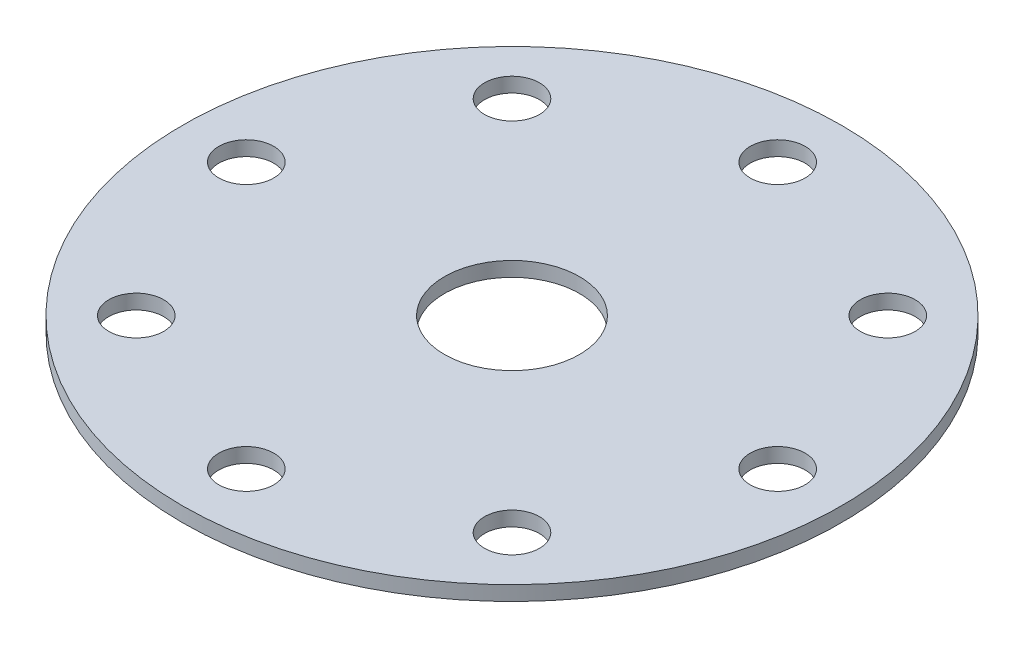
from build123d import *

# Parameters (mm, degrees)
SKETCH1_R                    = 57.15
BOSS_EXTRUDE1_DEPTH          = 2.54
F_1_12_TAPPED_HOLE1_D        = 23.41626
F_3_8_0_375_DIAMETER_HOLE1_D = 9.525


with BuildPart() as part:
    # Sketch1 → Boss-Extrude1 (new body)
    with BuildSketch(Plane(origin=(0, 0, 0), x_dir=(1, 0, 0), z_dir=(0, 1, 0))):
        with Locations(Location((0, 0, 0), (0, 0, 270))):
            Circle(SKETCH1_R)
    extrude(amount=BOSS_EXTRUDE1_DEPTH)

    # 1-12 Tapped Hole1 (through all)
    with Locations(Plane(origin=(0, 2.54, 0), x_dir=(1, 0, 0), z_dir=(0, 1, 0))):
        with Locations((0, 0)):
            Hole(F_1_12_TAPPED_HOLE1_D / 2)

    # 3_8 _0.375_ Diameter Hole1 (through all)
    with Locations(Plane(origin=(0, 2.54, 0), x_dir=(1, 0, 0), z_dir=(0, 1, 0))):
        with Locations((-46.0756, 0), (0, 46.0756), (32.580369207, 32.580369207), (-32.580369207, 32.580369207), (0, -46.0756), (32.580369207, -32.580369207), (-32.580369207, -32.580369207), (46.0756, 0)):
            Hole(F_3_8_0_375_DIAMETER_HOLE1_D / 2)


solid = part.part
